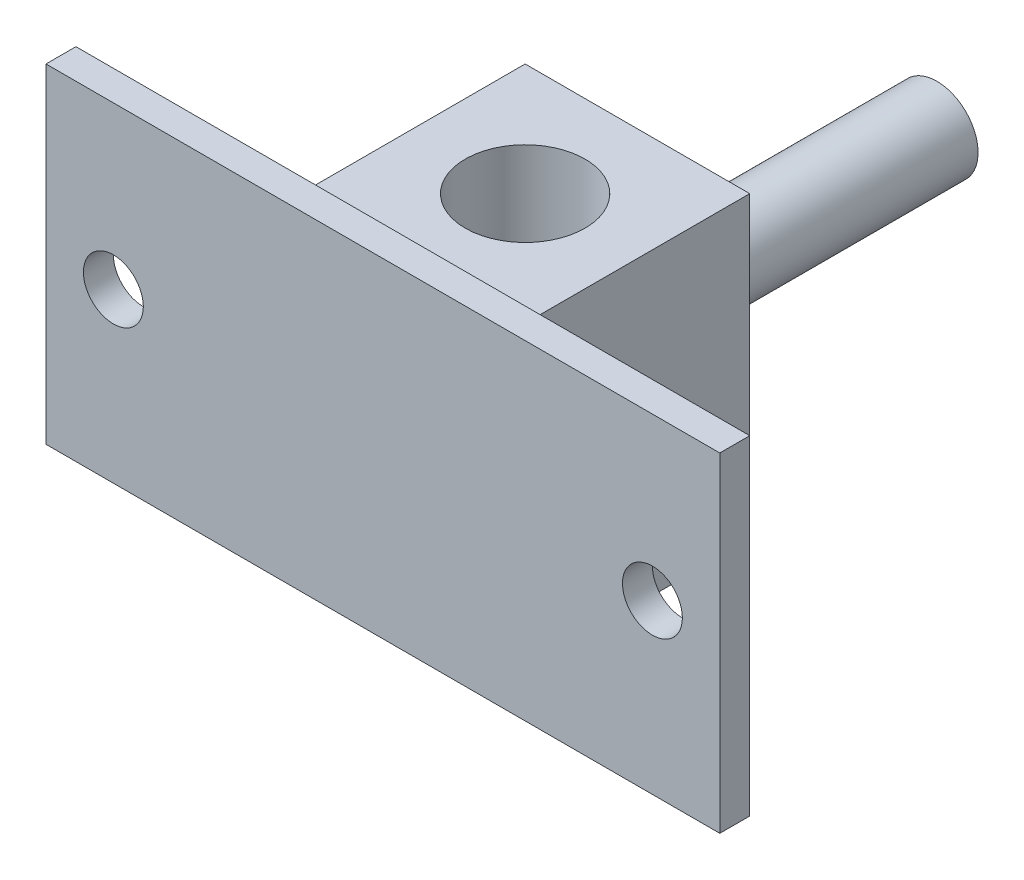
from build123d import *

# Parameters (mm, degrees)
SKETCH1_W           = 15
SKETCH1_H           = 20
BOSS_EXTRUDE1_DEPTH = 15
SKETCH2_R           = 4
CUT_EXTRUDE1_DEPTH  = 30
SKETCH3_W           = 45
SKETCH3_H           = 22
BOSS_EXTRUDE2_DEPTH = 2
SKETCH4_R           = 2
CUT_EXTRUDE2_DEPTH  = 2
SKETCH5_R           = 2.75
BOSS_EXTRUDE3_DEPTH = 20


with BuildPart() as part:
    # Sketch1 → Boss-Extrude1 (new body)
    with BuildSketch(Plane.XY):
        with Locations((7.5, 10)):
            Rectangle(SKETCH1_W, SKETCH1_H)
    extrude(amount=BOSS_EXTRUDE1_DEPTH)

    # Sketch2 → Cut-Extrude1 (cut)
    with BuildSketch(Plane(origin=(0, 20, 0), x_dir=(1, 0, 0), z_dir=(0, 1, 0))):
        with Locations(Location((7.5, -7.5, 0), (0, 0, 270))):
            Circle(SKETCH2_R)
    extrude(amount=-CUT_EXTRUDE1_DEPTH, mode=Mode.SUBTRACT)

    # Sketch3 → Boss-Extrude2 (add)
    with BuildSketch(Plane.XY.offset(15)):
        with Locations((7.5, 10)):
            Rectangle(SKETCH3_W, SKETCH3_H)
    extrude(amount=BOSS_EXTRUDE2_DEPTH)

    # Sketch4 → Cut-Extrude2 (cut)
    with BuildSketch(Plane.XY.offset(17)):
        with Locations((-10.5, 10.212027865)):
            Circle(SKETCH4_R)
        with Locations((25.5, 10.212027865)):
            Circle(SKETCH4_R)
    extrude(amount=-CUT_EXTRUDE2_DEPTH, mode=Mode.SUBTRACT)

    # Sketch5 → Boss-Extrude3 (add)
    with BuildSketch(Plane(origin=(0, 0, 0), x_dir=(-1, 0, 0), z_dir=(0, 0, -1))):
        with Locations((-7.5, 10)):
            Circle(SKETCH5_R)
    extrude(amount=BOSS_EXTRUDE3_DEPTH)


solid = part.part
